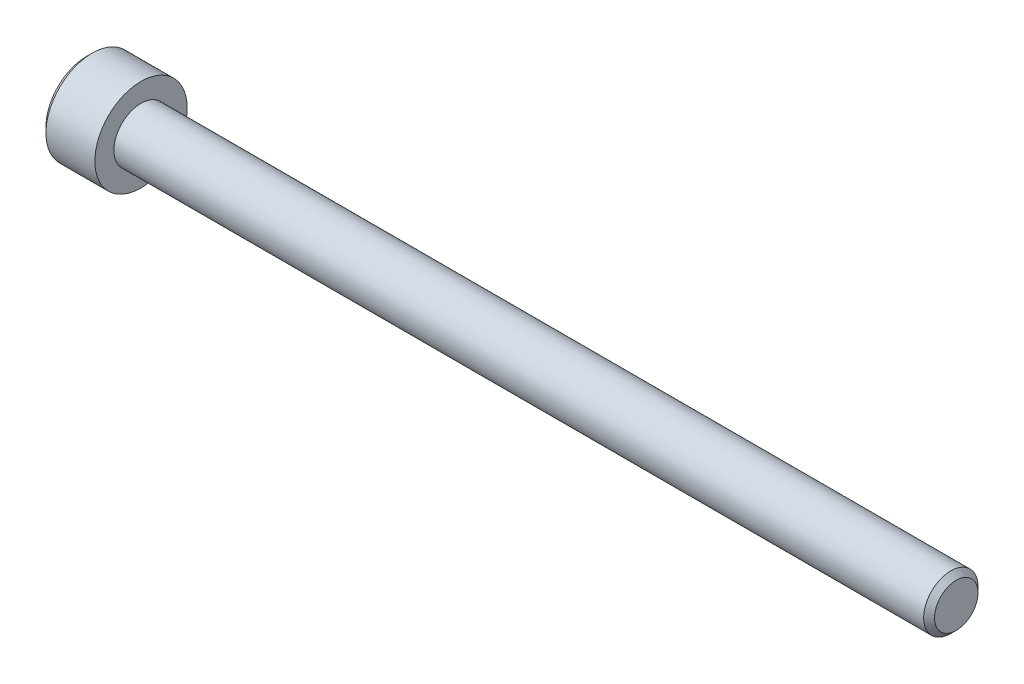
ISO-10303-21;
HEADER;
FILE_DESCRIPTION(('STEP AP214'),'2;1');
FILE_NAME('part.step','',(''),(''),'','','');
FILE_SCHEMA(('AUTOMOTIVE_DESIGN { 1 0 10303 214 1 1 1 1 }'));
ENDSEC;
DATA;
#1=APPLICATION_CONTEXT('core data for automotive mechanical design processes');
#2=APPLICATION_PROTOCOL_DEFINITION('international standard','automotive_design',2000,#1);
#3=PRODUCT_CONTEXT('',#1,'mechanical');
#4=PRODUCT('Part','Part','',(#3));
#5=PRODUCT_RELATED_PRODUCT_CATEGORY('part','',(#4));
#6=PRODUCT_DEFINITION_FORMATION('','',#4);
#7=PRODUCT_DEFINITION_CONTEXT('part definition',#1,'design');
#8=PRODUCT_DEFINITION('design','',#6,#7);
#9=PRODUCT_DEFINITION_SHAPE('','',#8);
#10=(LENGTH_UNIT() NAMED_UNIT(*) SI_UNIT(.MILLI.,.METRE.));
#11=(NAMED_UNIT(*) PLANE_ANGLE_UNIT() SI_UNIT($,.RADIAN.));
#12=(NAMED_UNIT(*) SI_UNIT($,.STERADIAN.) SOLID_ANGLE_UNIT());
#13=UNCERTAINTY_MEASURE_WITH_UNIT(LENGTH_MEASURE(1.E-05),#10,'distance_accuracy_value','');
#14=(GEOMETRIC_REPRESENTATION_CONTEXT(3) GLOBAL_UNCERTAINTY_ASSIGNED_CONTEXT((#13)) GLOBAL_UNIT_ASSIGNED_CONTEXT((#10,
#11,#12)) REPRESENTATION_CONTEXT('',''));
#15=CARTESIAN_POINT('',(0.,0.,0.));
#16=DIRECTION('',(0.,0.,1.));
#17=DIRECTION('',(1.,0.,0.));
#18=AXIS2_PLACEMENT_3D('',#15,#16,#17);
#19=CARTESIAN_POINT('',(-5.,0.,0.));
#20=DIRECTION('',(1.,0.,0.));
#21=DIRECTION('',(0.,0.,-1.));
#22=AXIS2_PLACEMENT_3D('',#19,#20,#21);
#23=PLANE('',#22);
#24=CARTESIAN_POINT('',(-5.,0.,0.));
#25=DIRECTION('',(1.,0.,0.));
#26=DIRECTION('',(0.,0.,-1.));
#27=AXIS2_PLACEMENT_3D('',#24,#25,#26);
#28=CIRCLE('',#27,3.75);
#29=CARTESIAN_POINT('',(-5.,0.,-3.75));
#30=VERTEX_POINT('',#29);
#31=EDGE_CURVE('E173',#30,#30,#28,.T.);
#32=ORIENTED_EDGE('',*,*,#31,.F.);
#33=EDGE_LOOP('',(#32));
#34=FACE_BOUND('',#33,.T.);
#35=DIRECTION('',(0.,0.5,-0.866025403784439));
#36=VECTOR('',#35,1.);
#37=CARTESIAN_POINT('',(-5.,-2.3094010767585,0.));
#38=LINE('',#37,#36);
#39=CARTESIAN_POINT('',(-5.,-2.3094010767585,0.));
#40=VERTEX_POINT('',#39);
#41=CARTESIAN_POINT('',(-5.,-1.15470053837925,-2.));
#42=VERTEX_POINT('',#41);
#43=EDGE_CURVE('E292',#40,#42,#38,.T.);
#44=ORIENTED_EDGE('',*,*,#43,.T.);
#45=DIRECTION('',(0.,1.,0.));
#46=VECTOR('',#45,1.);
#47=CARTESIAN_POINT('',(-5.,-1.15470053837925,-2.));
#48=LINE('',#47,#46);
#49=CARTESIAN_POINT('',(-5.,1.15470053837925,-2.));
#50=VERTEX_POINT('',#49);
#51=EDGE_CURVE('E296',#42,#50,#48,.T.);
#52=ORIENTED_EDGE('',*,*,#51,.T.);
#53=DIRECTION('',(0.,0.5,0.866025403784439));
#54=VECTOR('',#53,1.);
#55=CARTESIAN_POINT('',(-5.,1.15470053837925,-2.));
#56=LINE('',#55,#54);
#57=CARTESIAN_POINT('',(-5.,2.3094010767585,0.));
#58=VERTEX_POINT('',#57);
#59=EDGE_CURVE('E300',#50,#58,#56,.T.);
#60=ORIENTED_EDGE('',*,*,#59,.T.);
#61=DIRECTION('',(0.,-0.5,0.866025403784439));
#62=VECTOR('',#61,1.);
#63=CARTESIAN_POINT('',(-5.,2.3094010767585,0.));
#64=LINE('',#63,#62);
#65=CARTESIAN_POINT('',(-5.,1.15470053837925,2.));
#66=VERTEX_POINT('',#65);
#67=EDGE_CURVE('E128',#58,#66,#64,.T.);
#68=ORIENTED_EDGE('',*,*,#67,.T.);
#69=DIRECTION('',(0.,-1.,0.));
#70=VECTOR('',#69,1.);
#71=CARTESIAN_POINT('',(-5.,1.15470053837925,2.));
#72=LINE('',#71,#70);
#73=CARTESIAN_POINT('',(-5.,-1.15470053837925,2.));
#74=VERTEX_POINT('',#73);
#75=EDGE_CURVE('E287',#66,#74,#72,.T.);
#76=ORIENTED_EDGE('',*,*,#75,.T.);
#77=DIRECTION('',(0.,-0.5,-0.866025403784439));
#78=VECTOR('',#77,1.);
#79=CARTESIAN_POINT('',(-5.,-1.15470053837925,2.));
#80=LINE('',#79,#78);
#81=EDGE_CURVE('E144',#74,#40,#80,.T.);
#82=ORIENTED_EDGE('',*,*,#81,.T.);
#83=EDGE_LOOP('',(#44,#52,#60,#68,#76,#82));
#84=FACE_BOUND('',#83,.T.);
#85=ADVANCED_FACE('F41',(#34,#84),#23,.F.);
#86=CARTESIAN_POINT('',(-5.,0.,0.));
#87=DIRECTION('',(1.,0.,0.));
#88=DIRECTION('',(0.,0.,-1.));
#89=AXIS2_PLACEMENT_3D('',#86,#87,#88);
#90=CONICAL_SURFACE('',#89,3.75,0.785398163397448);
#91=CARTESIAN_POINT('',(-4.5,0.,0.));
#92=DIRECTION('',(1.,0.,0.));
#93=DIRECTION('',(0.,0.,-1.));
#94=AXIS2_PLACEMENT_3D('',#91,#92,#93);
#95=CIRCLE('',#94,4.25);
#96=CARTESIAN_POINT('',(-4.5,0.,-4.25));
#97=VERTEX_POINT('',#96);
#98=EDGE_CURVE('E169',#97,#97,#95,.T.);
#99=ORIENTED_EDGE('',*,*,#98,.F.);
#100=EDGE_LOOP('',(#99));
#101=FACE_BOUND('',#100,.T.);
#102=ORIENTED_EDGE('',*,*,#31,.T.);
#103=EDGE_LOOP('',(#102));
#104=FACE_BOUND('',#103,.T.);
#105=ADVANCED_FACE('F191',(#101,#104),#90,.T.);
#106=CARTESIAN_POINT('',(12.,0.,0.));
#107=DIRECTION('',(1.,0.,0.));
#108=DIRECTION('',(0.,0.,-1.));
#109=AXIS2_PLACEMENT_3D('',#106,#107,#108);
#110=CYLINDRICAL_SURFACE('',#109,4.25);
#111=CARTESIAN_POINT('',(0.,0.,0.));
#112=DIRECTION('',(1.,0.,0.));
#113=DIRECTION('',(0.,0.,-1.));
#114=AXIS2_PLACEMENT_3D('',#111,#112,#113);
#115=CIRCLE('',#114,4.25);
#116=CARTESIAN_POINT('',(0.,0.,-4.25));
#117=VERTEX_POINT('',#116);
#118=EDGE_CURVE('E165',#117,#117,#115,.T.);
#119=ORIENTED_EDGE('',*,*,#118,.F.);
#120=EDGE_LOOP('',(#119));
#121=FACE_BOUND('',#120,.T.);
#122=ORIENTED_EDGE('',*,*,#98,.T.);
#123=EDGE_LOOP('',(#122));
#124=FACE_BOUND('',#123,.T.);
#125=ADVANCED_FACE('F198',(#121,#124),#110,.T.);
#126=CARTESIAN_POINT('',(0.,4.25,0.));
#127=DIRECTION('',(-1.,0.,0.));
#128=DIRECTION('',(0.,0.,1.));
#129=AXIS2_PLACEMENT_3D('',#126,#127,#128);
#130=PLANE('',#129);
#131=CARTESIAN_POINT('',(0.,0.,0.));
#132=DIRECTION('',(1.,0.,0.));
#133=DIRECTION('',(0.,0.,-1.));
#134=AXIS2_PLACEMENT_3D('',#131,#132,#133);
#135=CIRCLE('',#134,2.5);
#136=CARTESIAN_POINT('',(0.,0.,-2.5));
#137=VERTEX_POINT('',#136);
#138=EDGE_CURVE('E160',#137,#137,#135,.T.);
#139=ORIENTED_EDGE('',*,*,#138,.F.);
#140=EDGE_LOOP('',(#139));
#141=FACE_BOUND('',#140,.T.);
#142=ORIENTED_EDGE('',*,*,#118,.T.);
#143=EDGE_LOOP('',(#142));
#144=FACE_BOUND('',#143,.T.);
#145=ADVANCED_FACE('F206',(#141,#144),#130,.F.);
#146=CARTESIAN_POINT('',(12.,0.,0.));
#147=DIRECTION('',(1.,0.,0.));
#148=DIRECTION('',(0.,0.,-1.));
#149=AXIS2_PLACEMENT_3D('',#146,#147,#148);
#150=CYLINDRICAL_SURFACE('',#149,2.5);
#151=CARTESIAN_POINT('',(74.5,0.,0.));
#152=DIRECTION('',(1.,0.,0.));
#153=DIRECTION('',(0.,0.,-1.));
#154=AXIS2_PLACEMENT_3D('',#151,#152,#153);
#155=CIRCLE('',#154,2.5);
#156=CARTESIAN_POINT('',(74.5,0.,-2.5));
#157=VERTEX_POINT('',#156);
#158=EDGE_CURVE('E11',#157,#157,#155,.F.);
#159=ORIENTED_EDGE('',*,*,#158,.T.);
#160=EDGE_LOOP('',(#159));
#161=FACE_BOUND('',#160,.T.);
#162=ORIENTED_EDGE('',*,*,#138,.T.);
#163=EDGE_LOOP('',(#162));
#164=FACE_BOUND('',#163,.T.);
#165=ADVANCED_FACE('F210',(#161,#164),#150,.T.);
#166=CARTESIAN_POINT('',(-2.5,1.15470053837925,2.));
#167=DIRECTION('',(0.,0.,-1.));
#168=DIRECTION('',(-1.,0.,0.));
#169=AXIS2_PLACEMENT_3D('',#166,#167,#168);
#170=PLANE('',#169);
#171=ORIENTED_EDGE('',*,*,#75,.F.);
#172=DIRECTION('',(-1.,0.,0.));
#173=VECTOR('',#172,1.);
#174=CARTESIAN_POINT('',(-2.5,1.15470053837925,2.));
#175=LINE('',#174,#173);
#176=CARTESIAN_POINT('',(-2.5,1.15470053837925,2.));
#177=VERTEX_POINT('',#176);
#178=EDGE_CURVE('E286',#177,#66,#175,.T.);
#179=ORIENTED_EDGE('',*,*,#178,.F.);
#180=DIRECTION('',(0.,-1.,0.));
#181=VECTOR('',#180,1.);
#182=CARTESIAN_POINT('',(-2.5,1.15470053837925,2.));
#183=LINE('',#182,#181);
#184=CARTESIAN_POINT('',(-2.5,0.,2.));
#185=VERTEX_POINT('',#184);
#186=EDGE_CURVE('E124',#177,#185,#183,.T.);
#187=ORIENTED_EDGE('',*,*,#186,.T.);
#188=CARTESIAN_POINT('',(-2.5,-1.15470053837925,2.));
#189=VERTEX_POINT('',#188);
#190=EDGE_CURVE('E116',#185,#189,#183,.T.);
#191=ORIENTED_EDGE('',*,*,#190,.T.);
#192=DIRECTION('',(-1.,0.,0.));
#193=VECTOR('',#192,1.);
#194=CARTESIAN_POINT('',(-2.5,-1.15470053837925,2.));
#195=LINE('',#194,#193);
#196=EDGE_CURVE('E120',#189,#74,#195,.T.);
#197=ORIENTED_EDGE('',*,*,#196,.T.);
#198=EDGE_LOOP('',(#171,#179,#187,#191,#197));
#199=FACE_BOUND('',#198,.T.);
#200=ADVANCED_FACE('F118',(#199),#170,.T.);
#201=CARTESIAN_POINT('',(-2.5,-1.15470053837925,2.));
#202=DIRECTION('',(0.,0.866025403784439,-0.5));
#203=DIRECTION('',(0.,0.5,0.866025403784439));
#204=AXIS2_PLACEMENT_3D('',#201,#202,#203);
#205=PLANE('',#204);
#206=ORIENTED_EDGE('',*,*,#81,.F.);
#207=ORIENTED_EDGE('',*,*,#196,.F.);
#208=DIRECTION('',(0.,-0.5,-0.866025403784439));
#209=VECTOR('',#208,1.);
#210=CARTESIAN_POINT('',(-2.5,-1.15470053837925,2.));
#211=LINE('',#210,#209);
#212=CARTESIAN_POINT('',(-2.5,-1.73205080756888,1.));
#213=VERTEX_POINT('',#212);
#214=EDGE_CURVE('E131',#189,#213,#211,.T.);
#215=ORIENTED_EDGE('',*,*,#214,.T.);
#216=CARTESIAN_POINT('',(-2.5,-2.3094010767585,0.));
#217=VERTEX_POINT('',#216);
#218=EDGE_CURVE('E139',#213,#217,#211,.T.);
#219=ORIENTED_EDGE('',*,*,#218,.T.);
#220=DIRECTION('',(-1.,0.,0.));
#221=VECTOR('',#220,1.);
#222=CARTESIAN_POINT('',(-2.5,-2.3094010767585,0.));
#223=LINE('',#222,#221);
#224=EDGE_CURVE('E147',#217,#40,#223,.T.);
#225=ORIENTED_EDGE('',*,*,#224,.T.);
#226=EDGE_LOOP('',(#206,#207,#215,#219,#225));
#227=FACE_BOUND('',#226,.T.);
#228=ADVANCED_FACE('F141',(#227),#205,.T.);
#229=CARTESIAN_POINT('',(-2.5,-2.3094010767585,0.));
#230=DIRECTION('',(0.,0.866025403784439,0.5));
#231=DIRECTION('',(0.,-0.5,0.866025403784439));
#232=AXIS2_PLACEMENT_3D('',#229,#230,#231);
#233=PLANE('',#232);
#234=ORIENTED_EDGE('',*,*,#43,.F.);
#235=ORIENTED_EDGE('',*,*,#224,.F.);
#236=DIRECTION('',(0.,0.5,-0.866025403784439));
#237=VECTOR('',#236,1.);
#238=CARTESIAN_POINT('',(-2.5,-2.3094010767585,0.));
#239=LINE('',#238,#237);
#240=CARTESIAN_POINT('',(-2.5,-1.73205080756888,-1.));
#241=VERTEX_POINT('',#240);
#242=EDGE_CURVE('E58',#217,#241,#239,.T.);
#243=ORIENTED_EDGE('',*,*,#242,.T.);
#244=CARTESIAN_POINT('',(-2.5,-1.15470053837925,-2.));
#245=VERTEX_POINT('',#244);
#246=EDGE_CURVE('E138',#241,#245,#239,.T.);
#247=ORIENTED_EDGE('',*,*,#246,.T.);
#248=DIRECTION('',(-1.,0.,0.));
#249=VECTOR('',#248,1.);
#250=CARTESIAN_POINT('',(-2.5,-1.15470053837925,-2.));
#251=LINE('',#250,#249);
#252=EDGE_CURVE('E155',#245,#42,#251,.T.);
#253=ORIENTED_EDGE('',*,*,#252,.T.);
#254=EDGE_LOOP('',(#234,#235,#243,#247,#253));
#255=FACE_BOUND('',#254,.T.);
#256=ADVANCED_FACE('F222',(#255),#233,.T.);
#257=CARTESIAN_POINT('',(-2.5,-1.15470053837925,-2.));
#258=DIRECTION('',(0.,0.,1.));
#259=DIRECTION('',(1.,0.,0.));
#260=AXIS2_PLACEMENT_3D('',#257,#258,#259);
#261=PLANE('',#260);
#262=ORIENTED_EDGE('',*,*,#51,.F.);
#263=ORIENTED_EDGE('',*,*,#252,.F.);
#264=DIRECTION('',(0.,1.,0.));
#265=VECTOR('',#264,1.);
#266=CARTESIAN_POINT('',(-2.5,-1.15470053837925,-2.));
#267=LINE('',#266,#265);
#268=CARTESIAN_POINT('',(-2.5,0.,-2.));
#269=VERTEX_POINT('',#268);
#270=EDGE_CURVE('E273',#245,#269,#267,.T.);
#271=ORIENTED_EDGE('',*,*,#270,.T.);
#272=CARTESIAN_POINT('',(-2.5,1.15470053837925,-2.));
#273=VERTEX_POINT('',#272);
#274=EDGE_CURVE('E261',#269,#273,#267,.T.);
#275=ORIENTED_EDGE('',*,*,#274,.T.);
#276=DIRECTION('',(-1.,0.,0.));
#277=VECTOR('',#276,1.);
#278=CARTESIAN_POINT('',(-2.5,1.15470053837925,-2.));
#279=LINE('',#278,#277);
#280=EDGE_CURVE('E277',#273,#50,#279,.T.);
#281=ORIENTED_EDGE('',*,*,#280,.T.);
#282=EDGE_LOOP('',(#262,#263,#271,#275,#281));
#283=FACE_BOUND('',#282,.T.);
#284=ADVANCED_FACE('F225',(#283),#261,.T.);
#285=CARTESIAN_POINT('',(-2.5,1.15470053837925,-2.));
#286=DIRECTION('',(0.,-0.866025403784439,0.5));
#287=DIRECTION('',(0.,-0.5,-0.866025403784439));
#288=AXIS2_PLACEMENT_3D('',#285,#286,#287);
#289=PLANE('',#288);
#290=ORIENTED_EDGE('',*,*,#59,.F.);
#291=ORIENTED_EDGE('',*,*,#280,.F.);
#292=DIRECTION('',(0.,0.5,0.866025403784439));
#293=VECTOR('',#292,1.);
#294=CARTESIAN_POINT('',(-2.5,1.15470053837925,-2.));
#295=LINE('',#294,#293);
#296=CARTESIAN_POINT('',(-2.5,1.73205080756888,-1.));
#297=VERTEX_POINT('',#296);
#298=EDGE_CURVE('E260',#273,#297,#295,.T.);
#299=ORIENTED_EDGE('',*,*,#298,.T.);
#300=CARTESIAN_POINT('',(-2.5,2.3094010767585,0.));
#301=VERTEX_POINT('',#300);
#302=EDGE_CURVE('E266',#297,#301,#295,.T.);
#303=ORIENTED_EDGE('',*,*,#302,.T.);
#304=DIRECTION('',(-1.,0.,0.));
#305=VECTOR('',#304,1.);
#306=CARTESIAN_POINT('',(-2.5,2.3094010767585,0.));
#307=LINE('',#306,#305);
#308=EDGE_CURVE('E310',#301,#58,#307,.T.);
#309=ORIENTED_EDGE('',*,*,#308,.T.);
#310=EDGE_LOOP('',(#290,#291,#299,#303,#309));
#311=FACE_BOUND('',#310,.T.);
#312=ADVANCED_FACE('F228',(#311),#289,.T.);
#313=CARTESIAN_POINT('',(-2.5,2.3094010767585,0.));
#314=DIRECTION('',(0.,-0.866025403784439,-0.5));
#315=DIRECTION('',(0.,0.5,-0.866025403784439));
#316=AXIS2_PLACEMENT_3D('',#313,#314,#315);
#317=PLANE('',#316);
#318=ORIENTED_EDGE('',*,*,#67,.F.);
#319=ORIENTED_EDGE('',*,*,#308,.F.);
#320=DIRECTION('',(0.,-0.5,0.866025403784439));
#321=VECTOR('',#320,1.);
#322=CARTESIAN_POINT('',(-2.5,2.3094010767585,0.));
#323=LINE('',#322,#321);
#324=CARTESIAN_POINT('',(-2.5,1.73205080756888,1.));
#325=VERTEX_POINT('',#324);
#326=EDGE_CURVE('E269',#301,#325,#323,.T.);
#327=ORIENTED_EDGE('',*,*,#326,.T.);
#328=EDGE_CURVE('E279',#325,#177,#323,.T.);
#329=ORIENTED_EDGE('',*,*,#328,.T.);
#330=ORIENTED_EDGE('',*,*,#178,.T.);
#331=EDGE_LOOP('',(#318,#319,#327,#329,#330));
#332=FACE_BOUND('',#331,.T.);
#333=ADVANCED_FACE('F231',(#332),#317,.T.);
#334=CARTESIAN_POINT('',(-2.5,0.,0.));
#335=DIRECTION('',(1.,0.,0.));
#336=DIRECTION('',(0.,0.,-1.));
#337=AXIS2_PLACEMENT_3D('',#334,#335,#336);
#338=PLANE('',#337);
#339=CARTESIAN_POINT('',(-2.5,0.,0.));
#340=DIRECTION('',(1.,0.,0.));
#341=DIRECTION('',(0.,0.,-1.));
#342=AXIS2_PLACEMENT_3D('',#339,#340,#341);
#343=CIRCLE('',#342,2.);
#344=EDGE_CURVE('E146',#269,#297,#343,.T.);
#345=ORIENTED_EDGE('',*,*,#344,.T.);
#346=ORIENTED_EDGE('',*,*,#298,.F.);
#347=ORIENTED_EDGE('',*,*,#274,.F.);
#348=EDGE_LOOP('',(#345,#346,#347));
#349=FACE_BOUND('',#348,.T.);
#350=ADVANCED_FACE('F235',(#349),#338,.F.);
#351=ORIENTED_EDGE('',*,*,#302,.F.);
#352=EDGE_CURVE('E154',#297,#325,#343,.T.);
#353=ORIENTED_EDGE('',*,*,#352,.T.);
#354=ORIENTED_EDGE('',*,*,#326,.F.);
#355=EDGE_LOOP('',(#351,#353,#354));
#356=FACE_BOUND('',#355,.T.);
#357=ADVANCED_FACE('F247',(#356),#338,.F.);
#358=EDGE_CURVE('E161',#325,#185,#343,.T.);
#359=ORIENTED_EDGE('',*,*,#358,.T.);
#360=ORIENTED_EDGE('',*,*,#186,.F.);
#361=ORIENTED_EDGE('',*,*,#328,.F.);
#362=EDGE_LOOP('',(#359,#360,#361));
#363=FACE_BOUND('',#362,.T.);
#364=ADVANCED_FACE('F253',(#363),#338,.F.);
#365=EDGE_CURVE('E133',#185,#213,#343,.T.);
#366=ORIENTED_EDGE('',*,*,#365,.T.);
#367=ORIENTED_EDGE('',*,*,#214,.F.);
#368=ORIENTED_EDGE('',*,*,#190,.F.);
#369=EDGE_LOOP('',(#366,#367,#368));
#370=FACE_BOUND('',#369,.T.);
#371=ADVANCED_FACE('F132',(#370),#338,.F.);
#372=EDGE_CURVE('E328',#213,#241,#343,.T.);
#373=ORIENTED_EDGE('',*,*,#372,.T.);
#374=ORIENTED_EDGE('',*,*,#242,.F.);
#375=ORIENTED_EDGE('',*,*,#218,.F.);
#376=EDGE_LOOP('',(#373,#374,#375));
#377=FACE_BOUND('',#376,.T.);
#378=ADVANCED_FACE('F238',(#377),#338,.F.);
#379=EDGE_CURVE('E152',#241,#269,#343,.T.);
#380=ORIENTED_EDGE('',*,*,#379,.T.);
#381=ORIENTED_EDGE('',*,*,#270,.F.);
#382=ORIENTED_EDGE('',*,*,#246,.F.);
#383=EDGE_LOOP('',(#380,#381,#382));
#384=FACE_BOUND('',#383,.T.);
#385=ADVANCED_FACE('F217',(#384),#338,.F.);
#386=CARTESIAN_POINT('',(-2.5,0.,0.));
#387=DIRECTION('',(-1.,0.,0.));
#388=DIRECTION('',(0.,0.,1.));
#389=AXIS2_PLACEMENT_3D('',#386,#387,#388);
#390=CONICAL_SURFACE('',#389,2.,1.30899693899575);
#391=CARTESIAN_POINT('',(-1.96410161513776,0.,0.));
#392=VERTEX_POINT('',#391);
#393=VERTEX_LOOP('',#392);
#394=FACE_BOUND('',#393,.T.);
#395=ORIENTED_EDGE('',*,*,#352,.F.);
#396=ORIENTED_EDGE('',*,*,#344,.F.);
#397=ORIENTED_EDGE('',*,*,#379,.F.);
#398=ORIENTED_EDGE('',*,*,#372,.F.);
#399=ORIENTED_EDGE('',*,*,#365,.F.);
#400=ORIENTED_EDGE('',*,*,#358,.F.);
#401=EDGE_LOOP('',(#395,#396,#397,#398,#399,#400));
#402=FACE_BOUND('',#401,.T.);
#403=ADVANCED_FACE('F187',(#394,#402),#390,.F.);
#404=CARTESIAN_POINT('',(75.,0.,0.));
#405=DIRECTION('',(1.,0.,0.));
#406=DIRECTION('',(0.,0.,-1.));
#407=AXIS2_PLACEMENT_3D('',#404,#405,#406);
#408=PLANE('',#407);
#409=CARTESIAN_POINT('',(75.,0.,0.));
#410=DIRECTION('',(1.,0.,0.));
#411=DIRECTION('',(0.,0.,-1.));
#412=AXIS2_PLACEMENT_3D('',#409,#410,#411);
#413=CIRCLE('',#412,2.);
#414=CARTESIAN_POINT('',(75.,0.,-2.));
#415=VERTEX_POINT('',#414);
#416=EDGE_CURVE('E51',#415,#415,#413,.T.);
#417=ORIENTED_EDGE('',*,*,#416,.T.);
#418=EDGE_LOOP('',(#417));
#419=FACE_BOUND('',#418,.T.);
#420=ADVANCED_FACE('F180',(#419),#408,.T.);
#421=CARTESIAN_POINT('',(75.,0.,0.));
#422=DIRECTION('',(-1.,0.,0.));
#423=DIRECTION('',(0.,0.,1.));
#424=AXIS2_PLACEMENT_3D('',#421,#422,#423);
#425=CONICAL_SURFACE('',#424,2.,0.785398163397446);
#426=ORIENTED_EDGE('',*,*,#158,.F.);
#427=EDGE_LOOP('',(#426));
#428=FACE_BOUND('',#427,.T.);
#429=ORIENTED_EDGE('',*,*,#416,.F.);
#430=EDGE_LOOP('',(#429));
#431=FACE_BOUND('',#430,.T.);
#432=ADVANCED_FACE('F44',(#428,#431),#425,.T.);
#433=CLOSED_SHELL('',(#85,#105,#125,#145,#165,#200,#228,#256,#284,#312,#333,#350,#357,#364,#371,
#378,#385,#403,#420,#432));
#434=MANIFOLD_SOLID_BREP('B2',#433);
#435=ADVANCED_BREP_SHAPE_REPRESENTATION('',(#18,#434),#14);
#436=SHAPE_DEFINITION_REPRESENTATION(#9,#435);
ENDSEC;
END-ISO-10303-21;
